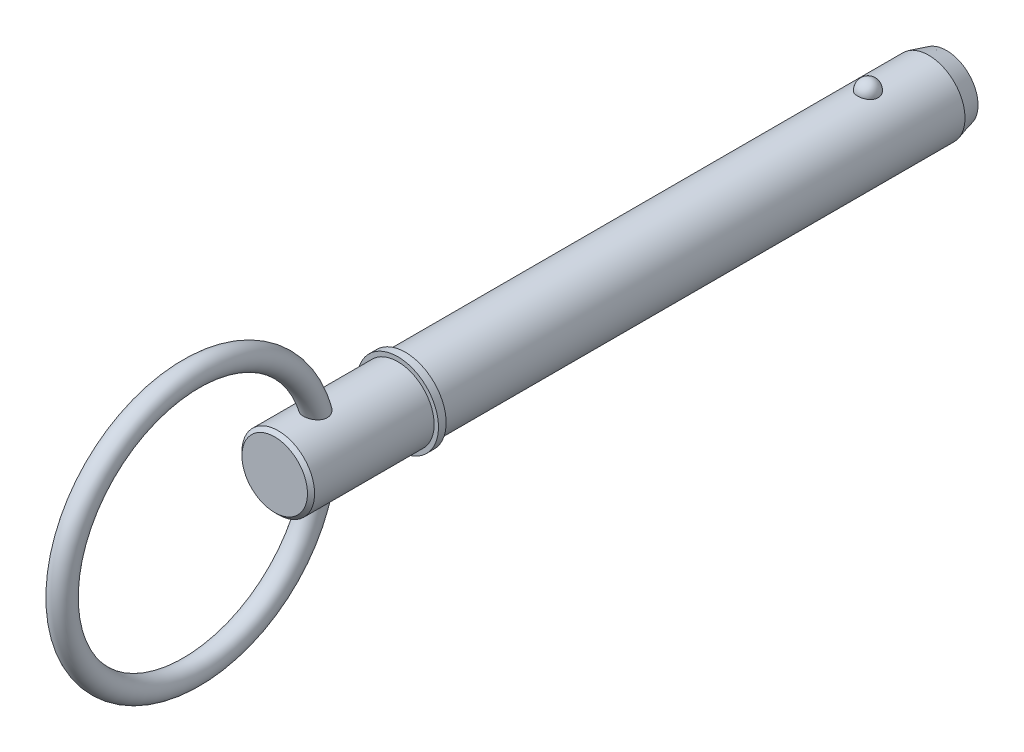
from build123d import *

# Parameters (mm, degrees)
SKETCH2_R           = 7.145
BOSS_EXTRUDE1_DEPTH = 88.9
BOSS_EXTRUDE2_START = 17.45
SKETCH3_R           = 7.145
BOSS_EXTRUDE2_DEPTH = 17.45
CHAMFER1_SIZE       = 3.5
CHAMFER1_SIZE2      = 0.937822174
SKETCH20_W          = 1.5
SKETCH20_H          = 8
SKETCH21_R          = 7.145
BOSS_EXTRUDE3_DEPTH = 25.7
CHAMFER2_SIZE       = 0.7
SKETCH24_R          = 2.25


with BuildPart() as part:
    # Sketch2 → Boss-Extrude1 (new body)
    with BuildSketch(Plane.XY):
        Circle(SKETCH2_R)
    extrude(amount=BOSS_EXTRUDE1_DEPTH)

    # Sketch3 → Boss-Extrude2 (add)
    with BuildSketch(Plane(origin=(0, 0, 0), x_dir=(-1, 0, 0), z_dir=(0, 0, -1)).offset(BOSS_EXTRUDE2_START)):
        Circle(SKETCH3_R)
    extrude(amount=-BOSS_EXTRUDE2_DEPTH)

    # Chamfer1
    chamfer1_edges = [part.edges().sort_by_distance(p)[0] for p in [
        (7.145, 0, -17.45),
    ]]
    chamfer1_side = [part.faces().sort_by_distance(p)[0] for p in [
        (7.145, 0, -8.725),
    ]]
    chamfer(chamfer1_edges, length=CHAMFER1_SIZE, length2=CHAMFER1_SIZE2, reference=chamfer1_side[0])

    # Sketch18 → Revolve1 (revolve)
    with BuildSketch(Plane(origin=(0, 0, 0), x_dir=(0, 0, -1), z_dir=(1, 0, 0))):
        with BuildLine():
            Line((2.02, 9.165), (2.02, 5.125))
            ThreePointArc((2.02, 5.125), (0, 7.145), (2.02, 9.165))
        make_face()
    revolve(axis=Axis((0, 9.165, -2.02), (0, -1, 0)))

    # Sketch20 → Revolve2 (revolve)
    with BuildSketch(Plane(origin=(0, 0, 0), x_dir=(0, 0, -1), z_dir=(1, 0, 0)), mode=Mode.PRIVATE) as revolve2_sk:
        with Locations((-89.65, 4)):
            Rectangle(SKETCH20_W, SKETCH20_H)
    revolve(revolve2_sk.sketch.rotate(Axis((0, 0, 33.728787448), (0, 0, 1)), 90), axis=Axis((0, 0, 33.728787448), (0, 0, 1)))

    # Sketch21 → Boss-Extrude3 (add)
    with BuildSketch(Plane(origin=(0, 0, 88.9), x_dir=(-1, 0, 0), z_dir=(0, 0, -1))):
        Circle(SKETCH21_R)
    extrude(amount=-BOSS_EXTRUDE3_DEPTH)

    # Chamfer2
    chamfer2_edges = [part.edges().sort_by_distance(p)[0] for p in [
        (7.145, 0, 114.6),
    ]]
    chamfer(chamfer2_edges, length=CHAMFER2_SIZE)

    # Sweep1: sweep along a path in Sketch23
    with BuildLine(Plane(origin=(0, 0, 0), x_dir=(0, 0, -1), z_dir=(1, 0, 0))) as sweep1_path:
        CenterArc((-131, 0), 25.4, 0, 360)
    # Sketch24 → Sweep1 (sweep)
    with BuildSketch(Plane(origin=(0, 0, 0), x_dir=(1, 0, 0), z_dir=(0, 1, 0))):
        with Locations((0, -105.6)):
            Circle(SKETCH24_R)
    sweep(path=sweep1_path.line)


solid = part.part
